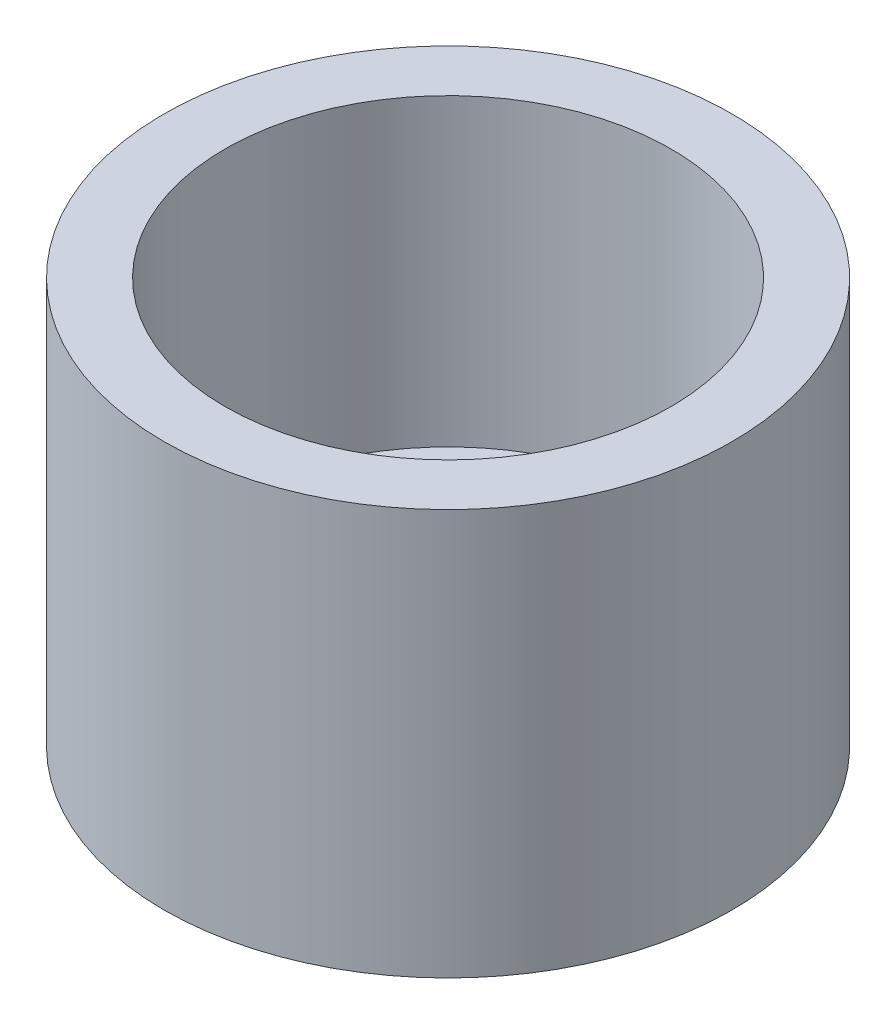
ISO-10303-21;
HEADER;
FILE_DESCRIPTION(('STEP AP214'),'2;1');
FILE_NAME('part.step','',(''),(''),'','','');
FILE_SCHEMA(('AUTOMOTIVE_DESIGN { 1 0 10303 214 1 1 1 1 }'));
ENDSEC;
DATA;
#1=APPLICATION_CONTEXT('core data for automotive mechanical design processes');
#2=APPLICATION_PROTOCOL_DEFINITION('international standard','automotive_design',2000,#1);
#3=PRODUCT_CONTEXT('',#1,'mechanical');
#4=PRODUCT('Part','Part','',(#3));
#5=PRODUCT_RELATED_PRODUCT_CATEGORY('part','',(#4));
#6=PRODUCT_DEFINITION_FORMATION('','',#4);
#7=PRODUCT_DEFINITION_CONTEXT('part definition',#1,'design');
#8=PRODUCT_DEFINITION('design','',#6,#7);
#9=PRODUCT_DEFINITION_SHAPE('','',#8);
#10=(LENGTH_UNIT() NAMED_UNIT(*) SI_UNIT(.MILLI.,.METRE.));
#11=(NAMED_UNIT(*) PLANE_ANGLE_UNIT() SI_UNIT($,.RADIAN.));
#12=(NAMED_UNIT(*) SI_UNIT($,.STERADIAN.) SOLID_ANGLE_UNIT());
#13=UNCERTAINTY_MEASURE_WITH_UNIT(LENGTH_MEASURE(1.E-05),#10,'distance_accuracy_value','');
#14=(GEOMETRIC_REPRESENTATION_CONTEXT(3) GLOBAL_UNCERTAINTY_ASSIGNED_CONTEXT((#13)) GLOBAL_UNIT_ASSIGNED_CONTEXT((#10,
#11,#12)) REPRESENTATION_CONTEXT('',''));
#15=CARTESIAN_POINT('',(0.,0.,0.));
#16=DIRECTION('',(0.,0.,1.));
#17=DIRECTION('',(1.,0.,0.));
#18=AXIS2_PLACEMENT_3D('',#15,#16,#17);
#19=CARTESIAN_POINT('',(0.,10.,0.));
#20=DIRECTION('',(0.,-1.,0.));
#21=DIRECTION('',(0.,0.,-1.));
#22=AXIS2_PLACEMENT_3D('',#19,#20,#21);
#23=CYLINDRICAL_SURFACE('',#22,7.);
#24=CARTESIAN_POINT('',(0.,10.,0.));
#25=DIRECTION('',(0.,1.,0.));
#26=DIRECTION('',(0.,0.,1.));
#27=AXIS2_PLACEMENT_3D('',#24,#25,#26);
#28=CIRCLE('',#27,7.);
#29=CARTESIAN_POINT('',(0.,10.,7.));
#30=VERTEX_POINT('',#29);
#31=EDGE_CURVE('E10',#30,#30,#28,.T.);
#32=ORIENTED_EDGE('',*,*,#31,.F.);
#33=EDGE_LOOP('',(#32));
#34=FACE_BOUND('',#33,.T.);
#35=CARTESIAN_POINT('',(0.,0.,0.));
#36=DIRECTION('',(0.,1.,0.));
#37=DIRECTION('',(0.,0.,1.));
#38=AXIS2_PLACEMENT_3D('',#35,#36,#37);
#39=CIRCLE('',#38,7.);
#40=CARTESIAN_POINT('',(0.,0.,7.));
#41=VERTEX_POINT('',#40);
#42=EDGE_CURVE('E40',#41,#41,#39,.T.);
#43=ORIENTED_EDGE('',*,*,#42,.T.);
#44=EDGE_LOOP('',(#43));
#45=FACE_BOUND('',#44,.T.);
#46=ADVANCED_FACE('F37',(#34,#45),#23,.T.);
#47=CARTESIAN_POINT('',(0.,10.,0.));
#48=DIRECTION('',(0.,1.,0.));
#49=DIRECTION('',(0.,0.,1.));
#50=AXIS2_PLACEMENT_3D('',#47,#48,#49);
#51=PLANE('',#50);
#52=CARTESIAN_POINT('',(0.,10.,0.));
#53=DIRECTION('',(0.,1.,0.));
#54=DIRECTION('',(0.,0.,1.));
#55=AXIS2_PLACEMENT_3D('',#52,#53,#54);
#56=CIRCLE('',#55,5.5);
#57=CARTESIAN_POINT('',(0.,10.,5.5));
#58=VERTEX_POINT('',#57);
#59=EDGE_CURVE('E51',#58,#58,#56,.T.);
#60=ORIENTED_EDGE('',*,*,#59,.F.);
#61=EDGE_LOOP('',(#60));
#62=FACE_BOUND('',#61,.T.);
#63=ORIENTED_EDGE('',*,*,#31,.T.);
#64=EDGE_LOOP('',(#63));
#65=FACE_BOUND('',#64,.T.);
#66=ADVANCED_FACE('F68',(#62,#65),#51,.T.);
#67=CARTESIAN_POINT('',(0.,0.,0.));
#68=DIRECTION('',(0.,1.,0.));
#69=DIRECTION('',(0.,0.,1.));
#70=AXIS2_PLACEMENT_3D('',#67,#68,#69);
#71=PLANE('',#70);
#72=ORIENTED_EDGE('',*,*,#42,.F.);
#73=EDGE_LOOP('',(#72));
#74=FACE_BOUND('',#73,.T.);
#75=ADVANCED_FACE('F64',(#74),#71,.F.);
#76=CARTESIAN_POINT('',(0.,2.5,0.));
#77=DIRECTION('',(0.,1.,0.));
#78=DIRECTION('',(0.,0.,1.));
#79=AXIS2_PLACEMENT_3D('',#76,#77,#78);
#80=CYLINDRICAL_SURFACE('',#79,5.5);
#81=CARTESIAN_POINT('',(0.,2.5,0.));
#82=DIRECTION('',(0.,1.,0.));
#83=DIRECTION('',(0.,0.,1.));
#84=AXIS2_PLACEMENT_3D('',#81,#82,#83);
#85=CIRCLE('',#84,5.5);
#86=CARTESIAN_POINT('',(0.,2.5,5.5));
#87=VERTEX_POINT('',#86);
#88=EDGE_CURVE('E49',#87,#87,#85,.T.);
#89=ORIENTED_EDGE('',*,*,#88,.F.);
#90=EDGE_LOOP('',(#89));
#91=FACE_BOUND('',#90,.T.);
#92=ORIENTED_EDGE('',*,*,#59,.T.);
#93=EDGE_LOOP('',(#92));
#94=FACE_BOUND('',#93,.T.);
#95=ADVANCED_FACE('F61',(#91,#94),#80,.F.);
#96=CARTESIAN_POINT('',(0.,2.5,0.));
#97=DIRECTION('',(0.,1.,0.));
#98=DIRECTION('',(0.,0.,1.));
#99=AXIS2_PLACEMENT_3D('',#96,#97,#98);
#100=PLANE('',#99);
#101=ORIENTED_EDGE('',*,*,#88,.T.);
#102=EDGE_LOOP('',(#101));
#103=FACE_BOUND('',#102,.T.);
#104=ADVANCED_FACE('F59',(#103),#100,.T.);
#105=CLOSED_SHELL('',(#46,#66,#75,#95,#104));
#106=MANIFOLD_SOLID_BREP('B2',#105);
#107=ADVANCED_BREP_SHAPE_REPRESENTATION('',(#18,#106),#14);
#108=SHAPE_DEFINITION_REPRESENTATION(#9,#107);
ENDSEC;
END-ISO-10303-21;
